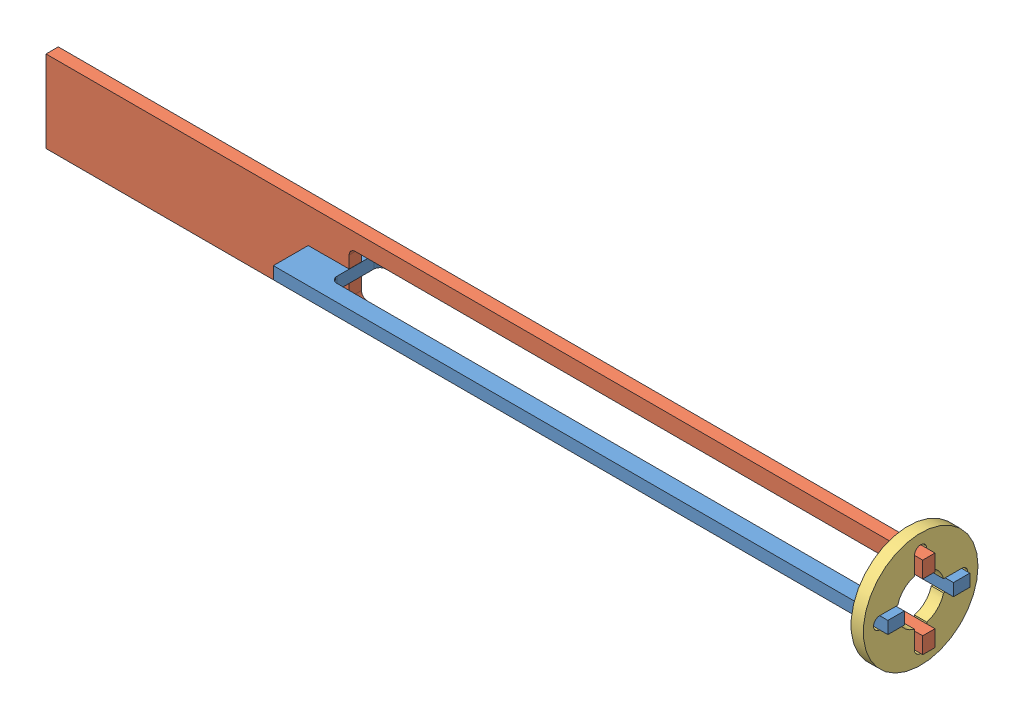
SolidWorks assembly Сборка1.SLDASM, configuration По умолчанию (file format 8000). Lengths in mm.
Overall size (107 14 14).
4 component instances, 4 part files, 8 mates.
Components (placement in the parent):
- t12-1-1: t12-1.SLDPRT [По умолчанию] at (20.5501 42.9362 51.5962) size (75 1.5 10)
- t12-2_v2-1: t12-2_v2.SLDPRT [По умолчанию] at (17.0779 43.8058 51.5962) x (1 0 0) z (0 1 0) size (107 1.5 10)
- t12-3-1: t12-3.SLDPRT [По умолчанию] at (71.5358 43.6862 50.8462) x (0 0 1) z (-1 0 0) size (14 14 1.5)
- Rrchka-1: Rrchka.SLDPRT [По умолчанию] at (70.0358 43.6862 50.8462) x (0 0.999852 0.017196) z (0 -0.017196 0.999852) (suppressed, hidden)
Mates (geometry in assembly coordinates):
- Совпадение1: coincident anti-aligned: plane of t12-1-1 through (-2.4642 44.4362 50.0962) normal (0 0 1); plane of t12-2_v2-1 through (17.0779 43.8058 50.0962) normal (0 0 -1)
- Совпадение2: coincident anti-aligned: plane of t12-1-1 through (-0.4642 42.9362 50.8462) normal (0 -1 0); plane of t12-2_v2-1 through (17.0779 42.9362 50.0962) normal (0 1 0)
- Совпадение3: coincident aligned: plane of t12-1-1 through (72.5358 44.4362 45.8462) normal (1 0 0); plane of t12-2_v2-1 through (72.5358 43.8058 50.0962) normal (1 0 0)
- Расстояние1: distance = 1 mm aligned: plane of t12-2_v2-1 through (72.5358 43.8058 50.0962) normal (1 0 0); plane of t12-3-1 through (71.5358 43.6862 50.8462) normal (1 0 0)
- Совпадение5: coincident anti-aligned: plane of t12-1-1 through (-0.4642 42.9362 50.8462) normal (0 -1 0); plane of t12-3-1 through (70.0358 42.9362 45.8462) normal (0 1 0)
- Совпадение6: coincident anti-aligned: plane of t12-2_v2-1 through (17.0779 43.8058 51.5962) normal (0 0 1); plane of t12-3-1 through (70.0358 40.8848 51.5962) normal (0 0 -1)
- Концентричный1: concentric anti-aligned: cylinder of t12-3-1 through (70.0358 43.6862 50.8462) axis (1 0 0) radius 7; cone of Rrchka-1 through (-40.9642 43.6862 50.8462) axis (-1 0 0)
- Совпадение7: coincident anti-aligned: plane of t12-3-1 through (70.0358 43.6862 50.8462) normal (-1 0 0); plane of Rrchka-1 through (70.0358 49.8103 50.9515) normal (1 0 0)
